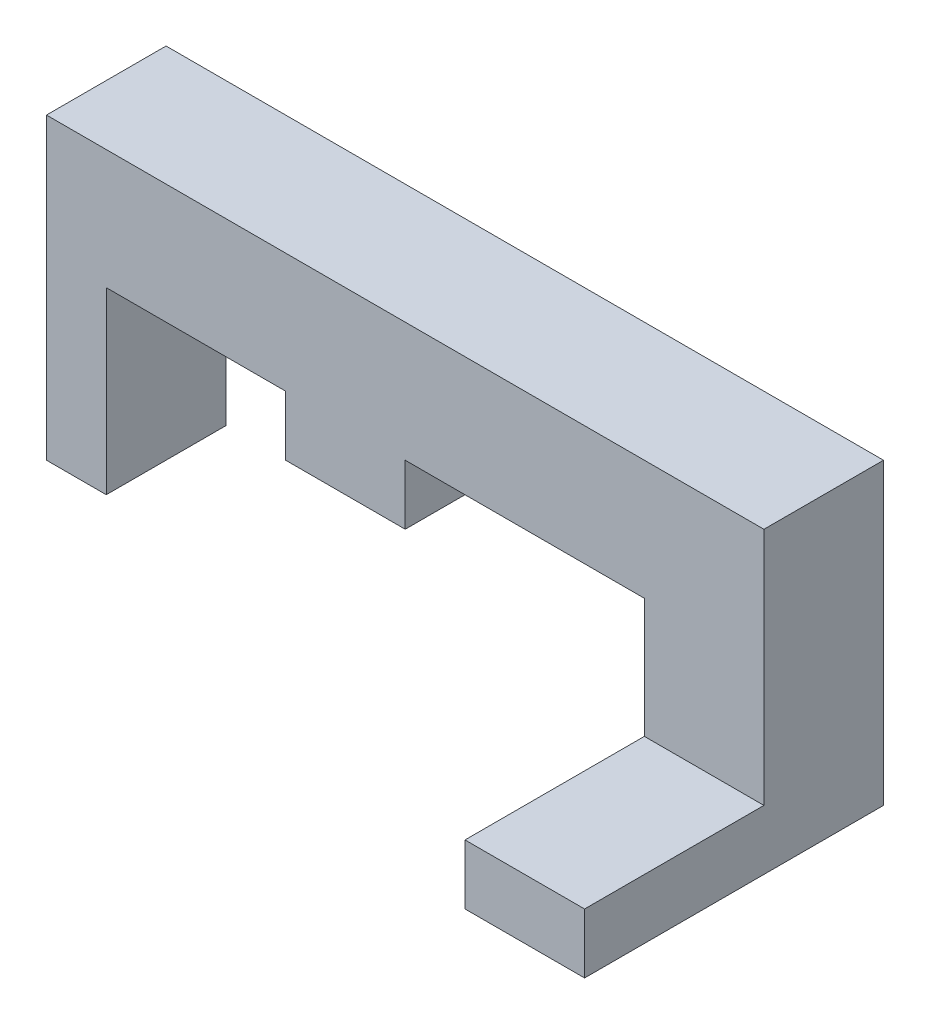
from build123d import *

# Parameters (mm, degrees)
CROQUIS1_W              = 120
CROQUIS1_H              = 50
SALIENTE_EXTRUIR1_DEPTH = 25
CROQUIS7_W              = 30
CROQUIS7_H              = 40
CORTAR_EXTRUIR6_DEPTH   = 126.099960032
CORTAR_EXTRUIR7_DEPTH   = 83.006097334
CROQUIS9_W              = 10
CROQUIS9_H              = 30
CORTAR_EXTRUIR8_DEPTH   = 77.321687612


with BuildPart() as part:
    # Croquis1 → Saliente-Extruir1 (new, symmetric)
    with BuildSketch(Plane.XY):
        Rectangle(CROQUIS1_W, CROQUIS1_H)
    extrude(amount=SALIENTE_EXTRUIR1_DEPTH, both=True)

    # Croquis7 → Cortar-Extruir6 (cut, through all)
    with BuildSketch(Plane(origin=(60, 0, 0), x_dir=(0, 0, -1), z_dir=(1, 0, 0))):
        with Locations((-10, 5)):
            Rectangle(CROQUIS7_W, CROQUIS7_H)
    extrude(amount=-CORTAR_EXTRUIR6_DEPTH, mode=Mode.SUBTRACT)

    # Croquis8 → Cortar-Extruir7 (cut, through all)
    with BuildSketch(Plane(origin=(0, 0, -25), x_dir=(-1, 0, 0), z_dir=(0, 0, -1))):
        Polygon((50, -25), (50, 5), (20, 5), (20, -5), (0, -5), (0, 5), (-40, 5), (-40, -25), align=None)
    extrude(amount=-CORTAR_EXTRUIR7_DEPTH, mode=Mode.SUBTRACT)

    # Croquis9 → Cortar-Extruir8 (cut, through all)
    with BuildSketch(Plane(origin=(0, -15, 0), x_dir=(1, 0, 0), z_dir=(0, 1, 0))):
        with Locations((-55, -10)):
            Rectangle(CROQUIS9_W, CROQUIS9_H)
    extrude(amount=-CORTAR_EXTRUIR8_DEPTH, mode=Mode.SUBTRACT)


solid = part.part
